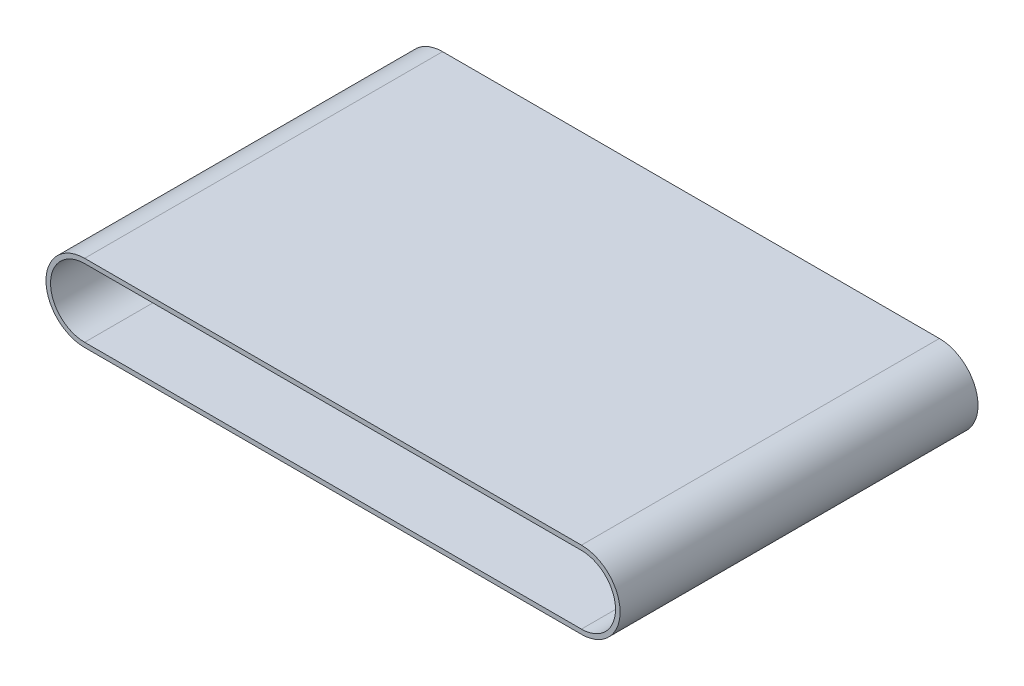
ISO-10303-21;
HEADER;
FILE_DESCRIPTION(('STEP AP214'),'2;1');
FILE_NAME('part.step','',(''),(''),'','','');
FILE_SCHEMA(('AUTOMOTIVE_DESIGN { 1 0 10303 214 1 1 1 1 }'));
ENDSEC;
DATA;
#1=APPLICATION_CONTEXT('core data for automotive mechanical design processes');
#2=APPLICATION_PROTOCOL_DEFINITION('international standard','automotive_design',2000,#1);
#3=PRODUCT_CONTEXT('',#1,'mechanical');
#4=PRODUCT('Part','Part','',(#3));
#5=PRODUCT_RELATED_PRODUCT_CATEGORY('part','',(#4));
#6=PRODUCT_DEFINITION_FORMATION('','',#4);
#7=PRODUCT_DEFINITION_CONTEXT('part definition',#1,'design');
#8=PRODUCT_DEFINITION('design','',#6,#7);
#9=PRODUCT_DEFINITION_SHAPE('','',#8);
#10=(LENGTH_UNIT() NAMED_UNIT(*) SI_UNIT(.MILLI.,.METRE.));
#11=(NAMED_UNIT(*) PLANE_ANGLE_UNIT() SI_UNIT($,.RADIAN.));
#12=(NAMED_UNIT(*) SI_UNIT($,.STERADIAN.) SOLID_ANGLE_UNIT());
#13=UNCERTAINTY_MEASURE_WITH_UNIT(LENGTH_MEASURE(1.E-05),#10,'distance_accuracy_value','');
#14=(GEOMETRIC_REPRESENTATION_CONTEXT(3) GLOBAL_UNCERTAINTY_ASSIGNED_CONTEXT((#13)) GLOBAL_UNIT_ASSIGNED_CONTEXT((#10,
#11,#12)) REPRESENTATION_CONTEXT('',''));
#15=CARTESIAN_POINT('',(0.,0.,0.));
#16=DIRECTION('',(0.,0.,1.));
#17=DIRECTION('',(1.,0.,0.));
#18=AXIS2_PLACEMENT_3D('',#15,#16,#17);
#19=CARTESIAN_POINT('',(3.33258608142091E-12,-21.5900000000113,761.335315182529));
#20=DIRECTION('',(0.,1.,0.));
#21=DIRECTION('',(-1.,0.,0.));
#22=AXIS2_PLACEMENT_3D('',#19,#20,#21);
#23=PLANE('',#22);
#24=DIRECTION('',(-1.,0.,0.));
#25=VECTOR('',#24,1.);
#26=CARTESIAN_POINT('',(-2.33318837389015E-11,-21.5900000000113,1084.99999999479));
#27=LINE('',#26,#25);
#28=CARTESIAN_POINT('',(3.72499493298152E-12,-21.5900000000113,1084.99999999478));
#29=VERTEX_POINT('',#28);
#30=CARTESIAN_POINT('',(-277.591438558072,-21.59000000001,1084.99999999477));
#31=VERTEX_POINT('',#30);
#32=EDGE_CURVE('E163',#29,#31,#27,.T.);
#33=ORIENTED_EDGE('',*,*,#32,.F.);
#34=DIRECTION('',(0.,0.,1.));
#35=VECTOR('',#34,1.);
#36=CARTESIAN_POINT('',(3.33258608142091E-12,-21.5900000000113,761.335315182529));
#37=LINE('',#36,#35);
#38=CARTESIAN_POINT('',(3.9674735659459E-12,-21.5900000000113,1284.99999999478));
#39=VERTEX_POINT('',#38);
#40=EDGE_CURVE('E54',#29,#39,#37,.T.);
#41=ORIENTED_EDGE('',*,*,#40,.T.);
#42=DIRECTION('',(-1.,0.,0.));
#43=VECTOR('',#42,1.);
#44=CARTESIAN_POINT('',(3.9674735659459E-12,-21.5900000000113,1284.99999999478));
#45=LINE('',#44,#43);
#46=CARTESIAN_POINT('',(-277.591438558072,-21.59000000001,1284.99999999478));
#47=VERTEX_POINT('',#46);
#48=EDGE_CURVE('E137',#39,#47,#45,.T.);
#49=ORIENTED_EDGE('',*,*,#48,.T.);
#50=DIRECTION('',(0.,0.,1.));
#51=VECTOR('',#50,1.);
#52=CARTESIAN_POINT('',(-277.591438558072,-21.59000000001,761.335315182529));
#53=LINE('',#52,#51);
#54=EDGE_CURVE('E140',#31,#47,#53,.T.);
#55=ORIENTED_EDGE('',*,*,#54,.F.);
#56=EDGE_LOOP('',(#33,#41,#49,#55));
#57=FACE_BOUND('',#56,.T.);
#58=ADVANCED_FACE('F39',(#57),#23,.F.);
#59=CARTESIAN_POINT('',(5.28007986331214E-13,-9.59062350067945E-12,761.335315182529));
#60=DIRECTION('',(0.,0.,1.));
#61=DIRECTION('',(1.,0.,0.));
#62=AXIS2_PLACEMENT_3D('',#59,#60,#61);
#63=CYLINDRICAL_SURFACE('',#62,21.5900000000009);
#64=CARTESIAN_POINT('',(9.20416837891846E-13,-9.57927962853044E-12,1084.99999999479));
#65=DIRECTION('',(0.,0.,-1.));
#66=DIRECTION('',(-1.,0.,0.));
#67=AXIS2_PLACEMENT_3D('',#64,#65,#66);
#68=CIRCLE('',#67,21.5900000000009);
#69=CARTESIAN_POINT('',(2.62324637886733E-13,21.5899999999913,1084.99999999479));
#70=VERTEX_POINT('',#69);
#71=EDGE_CURVE('E166',#70,#29,#68,.T.);
#72=ORIENTED_EDGE('',*,*,#71,.F.);
#73=DIRECTION('',(0.,0.,1.));
#74=VECTOR('',#73,1.);
#75=CARTESIAN_POINT('',(-1.30084213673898E-13,21.5899999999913,761.335315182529));
#76=LINE('',#75,#74);
#77=CARTESIAN_POINT('',(5.04803270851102E-13,21.5899999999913,1284.99999999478));
#78=VERTEX_POINT('',#77);
#79=EDGE_CURVE('E143',#70,#78,#76,.T.);
#80=ORIENTED_EDGE('',*,*,#79,.T.);
#81=CARTESIAN_POINT('',(1.16289547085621E-12,-9.57226998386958E-12,1284.99999999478));
#82=DIRECTION('',(0.,0.,-1.));
#83=DIRECTION('',(-1.,0.,0.));
#84=AXIS2_PLACEMENT_3D('',#81,#82,#83);
#85=CIRCLE('',#84,21.5900000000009);
#86=EDGE_CURVE('E135',#78,#39,#85,.T.);
#87=ORIENTED_EDGE('',*,*,#86,.T.);
#88=ORIENTED_EDGE('',*,*,#40,.F.);
#89=EDGE_LOOP('',(#72,#80,#87,#88));
#90=FACE_BOUND('',#89,.T.);
#91=ADVANCED_FACE('F165',(#90),#63,.T.);
#92=CARTESIAN_POINT('',(-277.591438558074,21.5899999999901,761.335315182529));
#93=DIRECTION('',(0.,-1.,0.));
#94=DIRECTION('',(1.,0.,0.));
#95=AXIS2_PLACEMENT_3D('',#92,#93,#94);
#96=PLANE('',#95);
#97=DIRECTION('',(1.,0.,0.));
#98=VECTOR('',#97,1.);
#99=CARTESIAN_POINT('',(-277.5914385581,21.5899999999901,1084.99999999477));
#100=LINE('',#99,#98);
#101=CARTESIAN_POINT('',(-277.591438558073,21.5899999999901,1084.99999999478));
#102=VERTEX_POINT('',#101);
#103=EDGE_CURVE('E151',#102,#70,#100,.T.);
#104=ORIENTED_EDGE('',*,*,#103,.F.);
#105=DIRECTION('',(0.,0.,1.));
#106=VECTOR('',#105,1.);
#107=CARTESIAN_POINT('',(-277.591438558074,21.5899999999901,761.335315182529));
#108=LINE('',#107,#106);
#109=CARTESIAN_POINT('',(-277.591438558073,21.5899999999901,1284.99999999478));
#110=VERTEX_POINT('',#109);
#111=EDGE_CURVE('E47',#102,#110,#108,.T.);
#112=ORIENTED_EDGE('',*,*,#111,.T.);
#113=DIRECTION('',(1.,0.,0.));
#114=VECTOR('',#113,1.);
#115=CARTESIAN_POINT('',(-277.591438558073,21.5899999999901,1284.99999999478));
#116=LINE('',#115,#114);
#117=EDGE_CURVE('E132',#110,#78,#116,.T.);
#118=ORIENTED_EDGE('',*,*,#117,.T.);
#119=ORIENTED_EDGE('',*,*,#79,.F.);
#120=EDGE_LOOP('',(#104,#112,#118,#119));
#121=FACE_BOUND('',#120,.T.);
#122=ADVANCED_FACE('F147',(#121),#96,.F.);
#123=CARTESIAN_POINT('',(-277.591438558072,-9.94883519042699E-12,761.335315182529));
#124=DIRECTION('',(0.,0.,1.));
#125=DIRECTION('',(1.,0.,0.));
#126=AXIS2_PLACEMENT_3D('',#123,#124,#125);
#127=CYLINDRICAL_SURFACE('',#126,21.59);
#128=CARTESIAN_POINT('',(-277.591438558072,-9.93749131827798E-12,1084.99999999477));
#129=DIRECTION('',(0.,0.,-1.));
#130=DIRECTION('',(-1.,0.,0.));
#131=AXIS2_PLACEMENT_3D('',#128,#129,#130);
#132=CIRCLE('',#131,21.59);
#133=EDGE_CURVE('E160',#31,#102,#132,.T.);
#134=ORIENTED_EDGE('',*,*,#133,.F.);
#135=ORIENTED_EDGE('',*,*,#54,.T.);
#136=CARTESIAN_POINT('',(-277.591438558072,-9.93048167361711E-12,1284.99999999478));
#137=DIRECTION('',(0.,0.,-1.));
#138=DIRECTION('',(-1.,0.,0.));
#139=AXIS2_PLACEMENT_3D('',#136,#137,#138);
#140=CIRCLE('',#139,21.59);
#141=EDGE_CURVE('E129',#47,#110,#140,.T.);
#142=ORIENTED_EDGE('',*,*,#141,.T.);
#143=ORIENTED_EDGE('',*,*,#111,.F.);
#144=EDGE_LOOP('',(#134,#135,#142,#143));
#145=FACE_BOUND('',#144,.T.);
#146=ADVANCED_FACE('F41',(#145),#127,.T.);
#147=CARTESIAN_POINT('',(-277.591438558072,-9.93048167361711E-12,1284.99999999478));
#148=DIRECTION('',(0.,0.,-1.));
#149=DIRECTION('',(-1.,0.,0.));
#150=AXIS2_PLACEMENT_3D('',#147,#148,#149);
#151=PLANE('',#150);
#152=ORIENTED_EDGE('',*,*,#141,.F.);
#153=ORIENTED_EDGE('',*,*,#48,.F.);
#154=ORIENTED_EDGE('',*,*,#86,.F.);
#155=ORIENTED_EDGE('',*,*,#117,.F.);
#156=EDGE_LOOP('',(#152,#153,#154,#155));
#157=FACE_BOUND('',#156,.T.);
#158=CARTESIAN_POINT('',(-277.591438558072,-9.57226998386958E-12,1284.99999999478));
#159=DIRECTION('',(0.,0.,-1.));
#160=DIRECTION('',(-1.,0.,0.));
#161=AXIS2_PLACEMENT_3D('',#158,#159,#160);
#162=CIRCLE('',#161,19.05);
#163=CARTESIAN_POINT('',(-277.591438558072,-19.0500000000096,1284.99999999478));
#164=VERTEX_POINT('',#163);
#165=CARTESIAN_POINT('',(-277.591438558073,19.0499999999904,1284.99999999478));
#166=VERTEX_POINT('',#165);
#167=EDGE_CURVE('E168',#164,#166,#162,.T.);
#168=ORIENTED_EDGE('',*,*,#167,.T.);
#169=DIRECTION('',(1.,0.,0.));
#170=VECTOR('',#169,1.);
#171=CARTESIAN_POINT('',(-277.591438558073,19.0499999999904,1284.99999999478));
#172=LINE('',#171,#170);
#173=CARTESIAN_POINT('',(5.01856837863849E-13,19.0499999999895,1284.99999999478));
#174=VERTEX_POINT('',#173);
#175=EDGE_CURVE('E175',#166,#174,#172,.T.);
#176=ORIENTED_EDGE('',*,*,#175,.T.);
#177=CARTESIAN_POINT('',(1.16289547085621E-12,-9.57226998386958E-12,1284.99999999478));
#178=DIRECTION('',(0.,0.,-1.));
#179=DIRECTION('',(-1.,0.,0.));
#180=AXIS2_PLACEMENT_3D('',#177,#178,#179);
#181=CIRCLE('',#180,19.0499999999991);
#182=CARTESIAN_POINT('',(1.82626705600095E-12,-19.0500000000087,1284.99999999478));
#183=VERTEX_POINT('',#182);
#184=EDGE_CURVE('E178',#174,#183,#181,.T.);
#185=ORIENTED_EDGE('',*,*,#184,.T.);
#186=DIRECTION('',(-1.,0.,0.));
#187=VECTOR('',#186,1.);
#188=CARTESIAN_POINT('',(1.82626705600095E-12,-19.0500000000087,1284.99999999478));
#189=LINE('',#188,#187);
#190=EDGE_CURVE('E119',#183,#164,#189,.T.);
#191=ORIENTED_EDGE('',*,*,#190,.T.);
#192=EDGE_LOOP('',(#168,#176,#185,#191));
#193=FACE_BOUND('',#192,.T.);
#194=ADVANCED_FACE('F157',(#157,#193),#151,.F.);
#195=CARTESIAN_POINT('',(1.19137957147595E-12,-19.0500000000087,761.335315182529));
#196=DIRECTION('',(0.,1.,0.));
#197=DIRECTION('',(-1.,0.,0.));
#198=AXIS2_PLACEMENT_3D('',#195,#196,#197);
#199=PLANE('',#198);
#200=DIRECTION('',(0.,0.,1.));
#201=VECTOR('',#200,1.);
#202=CARTESIAN_POINT('',(1.19137957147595E-12,-19.0500000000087,761.335315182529));
#203=LINE('',#202,#201);
#204=CARTESIAN_POINT('',(1.82626705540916E-12,-19.0500000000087,1084.99999999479));
#205=VERTEX_POINT('',#204);
#206=EDGE_CURVE('E111',#205,#183,#203,.T.);
#207=ORIENTED_EDGE('',*,*,#206,.F.);
#208=DIRECTION('',(-1.,0.,0.));
#209=VECTOR('',#208,1.);
#210=CARTESIAN_POINT('',(-2.54730902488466E-11,-19.0500000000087,1084.99999999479));
#211=LINE('',#210,#209);
#212=CARTESIAN_POINT('',(-277.591438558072,-19.0500000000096,1084.99999999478));
#213=VERTEX_POINT('',#212);
#214=EDGE_CURVE('E11',#205,#213,#211,.T.);
#215=ORIENTED_EDGE('',*,*,#214,.T.);
#216=DIRECTION('',(0.,0.,1.));
#217=VECTOR('',#216,1.);
#218=CARTESIAN_POINT('',(-277.591438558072,-19.0500000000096,761.335315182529));
#219=LINE('',#218,#217);
#220=EDGE_CURVE('E121',#213,#164,#219,.T.);
#221=ORIENTED_EDGE('',*,*,#220,.T.);
#222=ORIENTED_EDGE('',*,*,#190,.F.);
#223=EDGE_LOOP('',(#207,#215,#221,#222));
#224=FACE_BOUND('',#223,.T.);
#225=ADVANCED_FACE('F117',(#224),#199,.T.);
#226=CARTESIAN_POINT('',(5.28007986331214E-13,-9.59062350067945E-12,761.335315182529));
#227=DIRECTION('',(0.,0.,1.));
#228=DIRECTION('',(1.,0.,0.));
#229=AXIS2_PLACEMENT_3D('',#226,#227,#228);
#230=CYLINDRICAL_SURFACE('',#229,19.0499999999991);
#231=DIRECTION('',(0.,0.,1.));
#232=VECTOR('',#231,1.);
#233=CARTESIAN_POINT('',(-1.3303064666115E-13,19.0499999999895,761.335315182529));
#234=LINE('',#233,#232);
#235=CARTESIAN_POINT('',(1.84413095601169E-13,19.0499999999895,1084.9999999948));
#236=VERTEX_POINT('',#235);
#237=EDGE_CURVE('E113',#236,#174,#234,.T.);
#238=ORIENTED_EDGE('',*,*,#237,.F.);
#239=CARTESIAN_POINT('',(9.20416837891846E-13,-9.57927962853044E-12,1084.99999999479));
#240=DIRECTION('',(0.,0.,-1.));
#241=DIRECTION('',(-1.,0.,0.));
#242=AXIS2_PLACEMENT_3D('',#239,#240,#241);
#243=CIRCLE('',#242,19.0499999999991);
#244=EDGE_CURVE('E104',#236,#205,#243,.T.);
#245=ORIENTED_EDGE('',*,*,#244,.T.);
#246=ORIENTED_EDGE('',*,*,#206,.T.);
#247=ORIENTED_EDGE('',*,*,#184,.F.);
#248=EDGE_LOOP('',(#238,#245,#246,#247));
#249=FACE_BOUND('',#248,.T.);
#250=ADVANCED_FACE('F109',(#249),#230,.F.);
#251=CARTESIAN_POINT('',(-277.591438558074,19.0499999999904,761.335315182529));
#252=DIRECTION('',(0.,-1.,0.));
#253=DIRECTION('',(1.,0.,0.));
#254=AXIS2_PLACEMENT_3D('',#251,#252,#253);
#255=PLANE('',#254);
#256=DIRECTION('',(0.,0.,1.));
#257=VECTOR('',#256,1.);
#258=CARTESIAN_POINT('',(-277.591438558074,19.0499999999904,761.335315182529));
#259=LINE('',#258,#257);
#260=CARTESIAN_POINT('',(-277.591438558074,19.0499999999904,1084.99999999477));
#261=VERTEX_POINT('',#260);
#262=EDGE_CURVE('E123',#261,#166,#259,.T.);
#263=ORIENTED_EDGE('',*,*,#262,.F.);
#264=DIRECTION('',(1.,0.,0.));
#265=VECTOR('',#264,1.);
#266=CARTESIAN_POINT('',(-277.5914385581,19.0499999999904,1084.99999999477));
#267=LINE('',#266,#265);
#268=EDGE_CURVE('E115',#261,#236,#267,.T.);
#269=ORIENTED_EDGE('',*,*,#268,.T.);
#270=ORIENTED_EDGE('',*,*,#237,.T.);
#271=ORIENTED_EDGE('',*,*,#175,.F.);
#272=EDGE_LOOP('',(#263,#269,#270,#271));
#273=FACE_BOUND('',#272,.T.);
#274=ADVANCED_FACE('F183',(#273),#255,.T.);
#275=CARTESIAN_POINT('',(-277.591438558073,-9.59062350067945E-12,761.335315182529));
#276=DIRECTION('',(0.,0.,1.));
#277=DIRECTION('',(1.,0.,0.));
#278=AXIS2_PLACEMENT_3D('',#275,#276,#277);
#279=CYLINDRICAL_SURFACE('',#278,19.05);
#280=ORIENTED_EDGE('',*,*,#220,.F.);
#281=CARTESIAN_POINT('',(-277.591438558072,-9.57927962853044E-12,1084.99999999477));
#282=DIRECTION('',(0.,0.,-1.));
#283=DIRECTION('',(-1.,0.,0.));
#284=AXIS2_PLACEMENT_3D('',#281,#282,#283);
#285=CIRCLE('',#284,19.05);
#286=EDGE_CURVE('E62',#213,#261,#285,.T.);
#287=ORIENTED_EDGE('',*,*,#286,.T.);
#288=ORIENTED_EDGE('',*,*,#262,.T.);
#289=ORIENTED_EDGE('',*,*,#167,.F.);
#290=EDGE_LOOP('',(#280,#287,#288,#289));
#291=FACE_BOUND('',#290,.T.);
#292=ADVANCED_FACE('F187',(#291),#279,.F.);
#293=CARTESIAN_POINT('',(-277.591438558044,-1.42386102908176E-11,1084.99999999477));
#294=DIRECTION('',(0.,0.,-1.));
#295=DIRECTION('',(0.,-1.,0.));
#296=AXIS2_PLACEMENT_3D('',#293,#294,#295);
#297=PLANE('',#296);
#298=ORIENTED_EDGE('',*,*,#286,.F.);
#299=ORIENTED_EDGE('',*,*,#214,.F.);
#300=ORIENTED_EDGE('',*,*,#244,.F.);
#301=ORIENTED_EDGE('',*,*,#268,.F.);
#302=EDGE_LOOP('',(#298,#299,#300,#301));
#303=FACE_BOUND('',#302,.T.);
#304=ORIENTED_EDGE('',*,*,#32,.T.);
#305=ORIENTED_EDGE('',*,*,#133,.T.);
#306=ORIENTED_EDGE('',*,*,#103,.T.);
#307=ORIENTED_EDGE('',*,*,#71,.T.);
#308=EDGE_LOOP('',(#304,#305,#306,#307));
#309=FACE_BOUND('',#308,.T.);
#310=ADVANCED_FACE('F102',(#303,#309),#297,.T.);
#311=CLOSED_SHELL('',(#58,#91,#122,#146,#194,#225,#250,#274,#292,#310));
#312=MANIFOLD_SOLID_BREP('B2',#311);
#313=ADVANCED_BREP_SHAPE_REPRESENTATION('',(#18,#312),#14);
#314=SHAPE_DEFINITION_REPRESENTATION(#9,#313);
ENDSEC;
END-ISO-10303-21;
